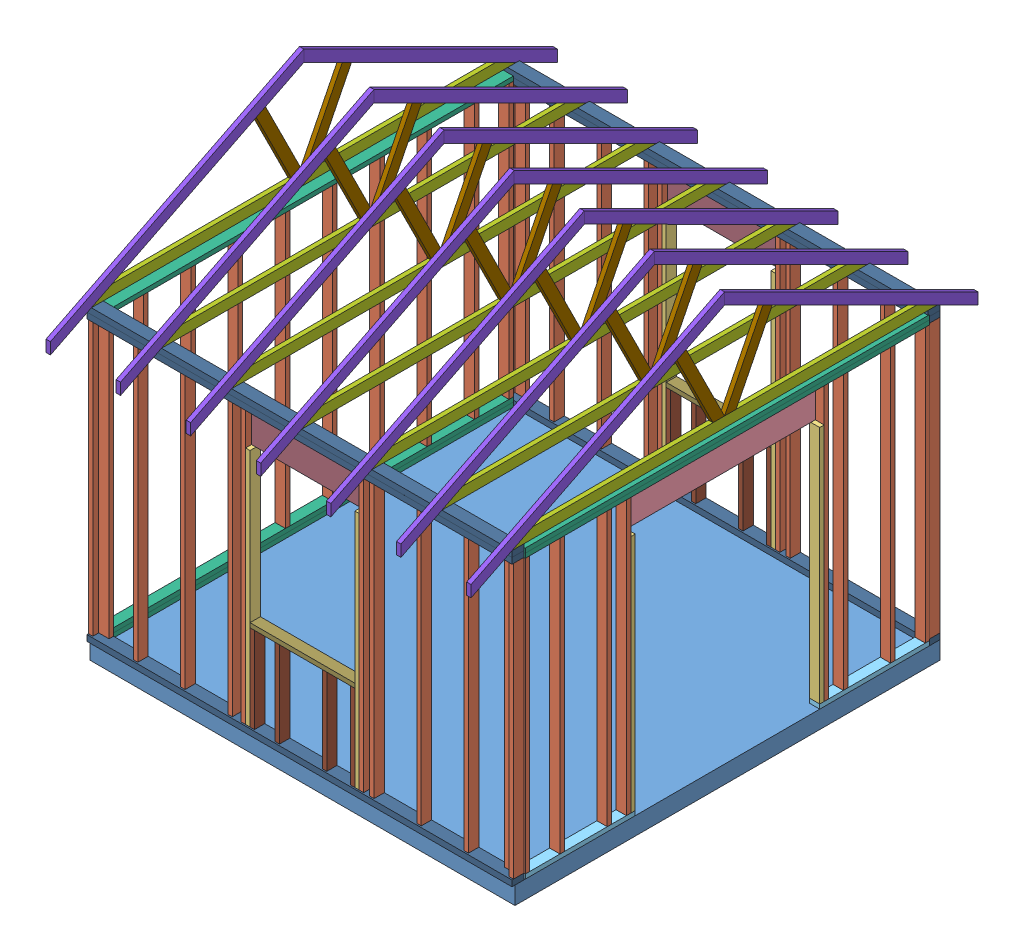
SolidWorks assembly DESN220-51C-MKrueger-complete shed.SLDASM, configuration Default (file format 6000). Lengths in mm.
Overall size (3657.6 3671.47 4441.28).
125 component instances, 13 part files, 17 mates.
Components (placement in the parent):
- DESN220-51C-MKrueger-SLAB-2: DESN220-51C-MKrueger-SLAB.SLDPRT [Default] at origin size (3657.6 152.4 3657.6)
- DESN220-51C-MKrueger-front wall with doorway-1: DESN220-51C-MKrueger-front wall with doorway.SLDASM [Default] at (1841.5 139.7 -1917.7) size (88.9 2466.97 3479.8)
  - DESN220-51C-MKrueger-2x4 STUD-1: DESN220-51C-MKrueger-2x4 STUD.SLDPRT [Default] at (-12.7 2403.475 177.8) x (1 0 0) z (0 -1 0) size (88.9 38.1 2352.68)
  - DESN220-51C-MKrueger-2x4x81-125-1: DESN220-51C-MKrueger-2x4x81-125.SLDPRT [Default] at (-12.7 50.8 2749.55) x (1 0 0) z (0 1 0) size (88.9 38.1 2060.57)
  - DESN220-51C-MKrueger-2x4x81-125-2: DESN220-51C-MKrueger-2x4x81-125.SLDPRT [Default] at (-12.7 2111.375 1085.85) x (1 0 0) z (0 -1 0) size (88.9 38.1 2060.57)
  - DESN220-51C-MKrueger-2x4 STUD-7: DESN220-51C-MKrueger-2x4 STUD.SLDPRT [Default] at (-12.7 2403.475 3619.5) x (1 0 0) z (0 -1 0) size (88.9 38.1 2352.68)
  - DESN220-51C-MKrueger-2x12x65-500-1: DESN220-51C-MKrueger-2x12x65-500.SLDPRT [Default] at (-88.9 2257.425 1917.7) x (0 0 -1) z (0 1 0) size (1663.7 12.7 292.1)
  - DESN220-51C-MKrueger-2x4 STUD-16: DESN220-51C-MKrueger-2x4 STUD.SLDPRT [Default] at (-12.7 2403.475 1047.75) x (1 0 0) z (0 -1 0) size (88.9 38.1 2352.68)
  - DESN220-51C-MKrueger-2x4 STUD-18: DESN220-51C-MKrueger-2x4 STUD.SLDPRT [Default] at (-12.7 2403.475 2749.55) x (1 0 0) z (0 -1 0) size (88.9 38.1 2352.68)
  - DESN220-51C-MKrueger-2x4x37-250-1: DESN220-51C-MKrueger-2x4x37-250.SLDPRT [Default] at (-57.15 12.7 3184.525) size (88.9 38.1 946.15)
  - DESN220-51C-MKrueger-2x4x37-250-2: DESN220-51C-MKrueger-2x4x37-250.SLDPRT [Default] at (-57.15 12.7 650.875) size (88.9 38.1 946.15)
  - DESN220-51C-MKrueger-2x4x137-1: DESN220-51C-MKrueger-2x4x137.SLDPRT [Default] at (-12.7 2403.475 177.8) size (88.9 38.1 3479.8)
  - DESN220-51C-MKrueger-2x4x137-2: DESN220-51C-MKrueger-2x4x137.SLDPRT [Default] at (-12.7 2441.575 177.8) size (88.9 38.1 3479.8)
  - DESN220-51C-MKrueger-2x4 STUD-19: DESN220-51C-MKrueger-2x4 STUD.SLDPRT [Default] at (-12.7 2403.475 476.25) x (1 0 0) z (0 -1 0) size (88.9 38.1 2352.68)
  - DESN220-51C-MKrueger-2x4 STUD-20: DESN220-51C-MKrueger-2x4 STUD.SLDPRT [Default] at (-12.7 2403.475 882.65) x (1 0 0) z (0 -1 0) size (88.9 38.1 2352.68)
  - DESN220-51C-MKrueger-2x4 STUD-21: DESN220-51C-MKrueger-2x4 STUD.SLDPRT [Default] at (-12.7 2403.475 2914.65) x (1 0 0) z (0 -1 0) size (88.9 38.1 2352.68)
  - DESN220-51C-MKrueger-2x4 STUD-22: DESN220-51C-MKrueger-2x4 STUD.SLDPRT [Default] at (-12.7 2403.475 3321.05) x (1 0 0) z (0 -1 0) size (88.9 38.1 2352.68)
- DESN220-51C-MKrueger-Roof Truss-1: DESN220-51C-MKrueger-Roof Truss.SLDASM [Default] at (1790.7 2657.475 -1803.4) x (0 -1 0) z (0 0 1) size (1190.07 38.1 4441.28)
  - DESN220-51C-MKrueger-2x4x144 63.43º-2: DESN220-51C-MKrueger-2x4x144 63.43º.SLDPRT [Default] at origin size (88.9 38.1 3657.6)
  - DESN220-51C-MKrueger-2x4x96 26.57º-1: DESN220-51C-MKrueger-2x4x96 26.57º.SLDPRT [Default] at (-1013.995 38.1 1828.8) x (-0.894389 0 0.447291) z (0.447291 0 0.894389) size (88.9 38.1 2482.86)
  - DESN220-51C-MKrueger-2x4x96 26.57º-2: DESN220-51C-MKrueger-2x4x96 26.57º.SLDPRT [Default] at (176.0765 0 -352.0771) x (0.894389 0 0.447291) z (-0.447291 0 0.894389) size (88.9 38.1 2482.86)
  - DESN220-51C-MKrueger-2x4x29.07 26.57º-1: DESN220-51C-MKrueger-2x4x29.07 26.57º.SLDPRT [Default] at (-749.2968 0 2159.3299) x (-0.447291 0 -0.894389) z (0.894389 0 -0.447291) size (88.9 38.1 738.38)
  - DESN220-51C-MKrueger-2x4x29.07 26.57º-2: DESN220-51C-MKrueger-2x4x29.07 26.57º.SLDPRT [Default] at (-749.2968 38.1 1498.2701) x (-0.447291 0 0.894389) z (0.894389 0 0.447291) size (88.9 38.1 738.38)
- DESN220-51C-MKrueger-Wall with window-1: DESN220-51C-MKrueger-Wall with window.SLDASM [Default] at (1828.8 152.4 -1727.2) x (0 0 1) z (-1 0 0) size (101.6 2505.08 3657.6)
  - DESN220-51C-MKrueger-2x4x144-5: DESN220-51C-MKrueger-2x4x144.SLDPRT [Default] at origin size (101.6 50.8 3657.6)
  - DESN220-51C-MKrueger-2x4 STUD-1: DESN220-51C-MKrueger-2x4 STUD.SLDPRT [Default] at (-12.7 2403.475 0) x (1 0 0) z (0 -1 0) size (88.9 38.1 2352.68)
  - DESN220-51C-MKrueger-2x4 STUD-2: DESN220-51C-MKrueger-2x4 STUD.SLDPRT [Default] at (-12.7 2403.475 387.35) x (1 0 0) z (0 -1 0) size (88.9 38.1 2352.68)
  - DESN220-51C-MKrueger-2x4 STUD-4: DESN220-51C-MKrueger-2x4 STUD.SLDPRT [Default] at (-101.6 50.8 127) x (0 0 1) z (0 1 0) size (88.9 38.1 2352.68)
  - DESN220-51C-MKrueger-2x4x29-125-1: DESN220-51C-MKrueger-2x4x29-125.SLDPRT [Default] at (-12.7 50.8 2266.95) x (1 0 0) z (0 1 0) size (88.9 38.1 739.77)
  - DESN220-51C-MKrueger-2x4x29-125-2: DESN220-51C-MKrueger-2x4x29-125.SLDPRT [Default] at (-12.7 50.8 1403.35) x (1 0 0) z (0 1 0) size (88.9 38.1 739.77)
  - DESN220-51C-MKrueger-2x4x29-125-3: DESN220-51C-MKrueger-2x4x29-125.SLDPRT [Default] at (-12.7 790.575 1606.55) x (1 0 0) z (0 -1 0) size (88.9 38.1 739.77)
  - DESN220-51C-MKrueger-2x4x29-125-4: DESN220-51C-MKrueger-2x4x29-125.SLDPRT [Default] at (-12.7 790.575 2012.95) x (1 0 0) z (0 -1 0) size (88.9 38.1 739.77)
  - DESN220-51C-MKrueger-2x4 STUD-6: DESN220-51C-MKrueger-2x4 STUD.SLDPRT [Default] at (-12.7 2403.475 2305.05) x (1 0 0) z (0 -1 0) size (88.9 38.1 2352.68)
  - DESN220-51C-MKrueger-2x4x81-125-1: DESN220-51C-MKrueger-2x4x81-125.SLDPRT [Default] at (-12.7 50.8 2305.05) x (1 0 0) z (0 1 0) size (88.9 38.1 2060.57)
  - DESN220-51C-MKrueger-2x4x35-500-1: DESN220-51C-MKrueger-2x4x35-500.SLDPRT [Default] at (-12.7 790.575 1365.25) size (88.9 38.1 901.7)
  - DESN220-51C-MKrueger-2x4x81-125-2: DESN220-51C-MKrueger-2x4x81-125.SLDPRT [Default] at (-12.7 2111.375 1327.15) x (1 0 0) z (0 -1 0) size (88.9 38.1 2060.57)
  - DESN220-51C-MKrueger-2x12x38-500-1: DESN220-51C-MKrueger-2x12x38-500.SLDPRT [Default] at (-101.6 2111.375 1327.15) x (0 -1 0) z (0 0 1) size (292.1 38.1 977.9)
  - DESN220-51C-MKrueger-2x4 STUD-7: DESN220-51C-MKrueger-2x4 STUD.SLDPRT [Default] at (-12.7 2403.475 3619.5) x (1 0 0) z (0 -1 0) size (88.9 38.1 2352.68)
  - DESN220-51C-MKrueger-2x4 STUD-8: DESN220-51C-MKrueger-2x4 STUD.SLDPRT [Default] at (-101.6 2403.475 3530.6) x (0 0 -1) z (0 -1 0) size (88.9 38.1 2352.68)
  - DESN220-51C-MKrueger-2x4 STUD-9: DESN220-51C-MKrueger-2x4 STUD.SLDPRT [Default] at (-12.7 2403.475 793.75) x (1 0 0) z (0 -1 0) size (88.9 38.1 2352.68)
  - DESN220-51C-MKrueger-2x4 STUD-10: DESN220-51C-MKrueger-2x4 STUD.SLDPRT [Default] at (-12.7 2403.475 1200.15) x (1 0 0) z (0 -1 0) size (88.9 38.1 2352.68)
  - DESN220-51C-MKrueger-2x4 STUD-11: DESN220-51C-MKrueger-2x4 STUD.SLDPRT [Default] at (-12.7 2403.475 1606.55) x (1 0 0) z (0 -1 0) size (88.9 38.1 2352.68) (suppressed, hidden)
  - DESN220-51C-MKrueger-2x4 STUD-12: DESN220-51C-MKrueger-2x4 STUD.SLDPRT [Default] at (-12.7 2403.475 2012.95) x (1 0 0) z (0 -1 0) size (88.9 38.1 2352.68) (suppressed, hidden)
  - DESN220-51C-MKrueger-2x4 STUD-13: DESN220-51C-MKrueger-2x4 STUD.SLDPRT [Default] at (-12.7 2403.475 2419.35) x (1 0 0) z (0 -1 0) size (88.9 38.1 2352.68)
  - DESN220-51C-MKrueger-2x4 STUD-14: DESN220-51C-MKrueger-2x4 STUD.SLDPRT [Default] at (-12.7 2403.475 2825.75) x (1 0 0) z (0 -1 0) size (88.9 38.1 2352.68)
  - DESN220-51C-MKrueger-2x4 STUD-15: DESN220-51C-MKrueger-2x4 STUD.SLDPRT [Default] at (-12.7 2403.475 3232.15) x (1 0 0) z (0 -1 0) size (88.9 38.1 2352.68)
  - DESN220-51C-MKrueger-2x4x144-6: DESN220-51C-MKrueger-2x4x144.SLDPRT [Default] at (0 2454.275 0) size (101.6 50.8 3657.6)
  - DESN220-51C-MKrueger-2x4x144-7: DESN220-51C-MKrueger-2x4x144.SLDPRT [Default] at (0 2403.475 0) size (101.6 50.8 3657.6)
  - DESN220-51C-MKrueger-2x4 STUD-16: DESN220-51C-MKrueger-2x4 STUD.SLDPRT [Default] at (-12.7 50.8 1327.15) x (1 0 0) z (0 1 0) size (88.9 38.1 2352.68)
- DESN220-51C-MKrueger-Wall without window-1: DESN220-51C-MKrueger-Wall without window.SLDASM [Default] at (-1828.8 228.6 1752.6) x (0 1 0) z (0 0 -1) size (2466.98 88.9 3479.8)
  - DESN220-51C-MKrueger-2x4x137-3: DESN220-51C-MKrueger-2x4x137.SLDPRT [Default] at (0 88.9 0) x (0 1 0) z (0 0 1) size (88.9 38.1 3479.8)
  - DESN220-51C-MKrueger-2x4 STUD-2: DESN220-51C-MKrueger-2x4 STUD.SLDPRT [Default] at (2352.675 0 0) x (0 -1 0) z (-1 0 0) size (88.9 38.1 2352.68)
  - DESN220-51C-MKrueger-2x4x137-4: DESN220-51C-MKrueger-2x4x137.SLDPRT [Default] at (-76.2 0 0) x (0 -1 0) z (0 0 1) size (88.9 38.1 3479.8)
  - DESN220-51C-MKrueger-2x4x137-5: DESN220-51C-MKrueger-2x4x137.SLDPRT [Default] at (2390.775 88.9 0) x (0 1 0) z (0 0 1) size (88.9 38.1 3479.8)
  - DESN220-51C-MKrueger-2x4 STUD-3: DESN220-51C-MKrueger-2x4 STUD.SLDPRT [Default] at (2352.675 0 298.45) x (0 -1 0) z (-1 0 0) size (88.9 38.1 2352.68)
  - DESN220-51C-MKrueger-2x4 STUD-5: DESN220-51C-MKrueger-2x4 STUD.SLDPRT [Default] at (0 0 742.95) x (0 -1 0) z (1 0 0) size (88.9 38.1 2352.68)
  - DESN220-51C-MKrueger-2x4 STUD-6: DESN220-51C-MKrueger-2x4 STUD.SLDPRT [Default] at (0 0 1149.35) x (0 -1 0) z (1 0 0) size (88.9 38.1 2352.68)
  - DESN220-51C-MKrueger-2x4 STUD-7: DESN220-51C-MKrueger-2x4 STUD.SLDPRT [Default] at (0 0 1555.75) x (0 -1 0) z (1 0 0) size (88.9 38.1 2352.68)
  - DESN220-51C-MKrueger-2x4 STUD-8: DESN220-51C-MKrueger-2x4 STUD.SLDPRT [Default] at (0 0 2368.55) x (0 -1 0) z (1 0 0) size (88.9 38.1 2352.68)
  - DESN220-51C-MKrueger-2x4 STUD-9: DESN220-51C-MKrueger-2x4 STUD.SLDPRT [Default] at (0 0 1962.15) x (0 -1 0) z (1 0 0) size (88.9 38.1 2352.68)
  - DESN220-51C-MKrueger-2x4 STUD-10: DESN220-51C-MKrueger-2x4 STUD.SLDPRT [Default] at (0 0 3181.35) x (0 -1 0) z (1 0 0) size (88.9 38.1 2352.68)
  - DESN220-51C-MKrueger-2x4 STUD-11: DESN220-51C-MKrueger-2x4 STUD.SLDPRT [Default] at (0 0 2774.95) x (0 -1 0) z (1 0 0) size (88.9 38.1 2352.68)
  - DESN220-51C-MKrueger-2x4 STUD-12: DESN220-51C-MKrueger-2x4 STUD.SLDPRT [Default] at (2352.675 88.9 3479.8) x (0 1 0) z (-1 0 0) size (88.9 38.1 2352.68)
- DESN220-51C-MKrueger-Wall with window-2: DESN220-51C-MKrueger-Wall with window.SLDASM [Default] at (1828.8 152.4 1854.2) x (0 0 1) z (-1 0 0) size (101.6 2505.08 3657.6)
  - DESN220-51C-MKrueger-2x4x144-5: DESN220-51C-MKrueger-2x4x144.SLDPRT [Default] at origin size (101.6 50.8 3657.6)
  - DESN220-51C-MKrueger-2x4 STUD-1: DESN220-51C-MKrueger-2x4 STUD.SLDPRT [Default] at (-12.7 2403.475 0) x (1 0 0) z (0 -1 0) size (88.9 38.1 2352.68)
  - DESN220-51C-MKrueger-2x4 STUD-2: DESN220-51C-MKrueger-2x4 STUD.SLDPRT [Default] at (-12.7 2403.475 387.35) x (1 0 0) z (0 -1 0) size (88.9 38.1 2352.68)
  - DESN220-51C-MKrueger-2x4 STUD-4: DESN220-51C-MKrueger-2x4 STUD.SLDPRT [Default] at (-101.6 50.8 127) x (0 0 1) z (0 1 0) size (88.9 38.1 2352.68)
  - DESN220-51C-MKrueger-2x4x29-125-1: DESN220-51C-MKrueger-2x4x29-125.SLDPRT [Default] at (-12.7 50.8 2266.95) x (1 0 0) z (0 1 0) size (88.9 38.1 739.77)
  - DESN220-51C-MKrueger-2x4x29-125-2: DESN220-51C-MKrueger-2x4x29-125.SLDPRT [Default] at (-12.7 50.8 1403.35) x (1 0 0) z (0 1 0) size (88.9 38.1 739.77)
  - DESN220-51C-MKrueger-2x4x29-125-3: DESN220-51C-MKrueger-2x4x29-125.SLDPRT [Default] at (-12.7 790.575 1606.55) x (1 0 0) z (0 -1 0) size (88.9 38.1 739.77)
  - DESN220-51C-MKrueger-2x4x29-125-4: DESN220-51C-MKrueger-2x4x29-125.SLDPRT [Default] at (-12.7 790.575 2012.95) x (1 0 0) z (0 -1 0) size (88.9 38.1 739.77)
  - DESN220-51C-MKrueger-2x4 STUD-6: DESN220-51C-MKrueger-2x4 STUD.SLDPRT [Default] at (-12.7 2403.475 2305.05) x (1 0 0) z (0 -1 0) size (88.9 38.1 2352.68)
  - DESN220-51C-MKrueger-2x4x81-125-1: DESN220-51C-MKrueger-2x4x81-125.SLDPRT [Default] at (-12.7 50.8 2305.05) x (1 0 0) z (0 1 0) size (88.9 38.1 2060.57)
  - DESN220-51C-MKrueger-2x4x35-500-1: DESN220-51C-MKrueger-2x4x35-500.SLDPRT [Default] at (-12.7 790.575 1365.25) size (88.9 38.1 901.7)
  - DESN220-51C-MKrueger-2x4x81-125-2: DESN220-51C-MKrueger-2x4x81-125.SLDPRT [Default] at (-12.7 2111.375 1327.15) x (1 0 0) z (0 -1 0) size (88.9 38.1 2060.57)
  - DESN220-51C-MKrueger-2x12x38-500-1: DESN220-51C-MKrueger-2x12x38-500.SLDPRT [Default] at (-101.6 2111.375 1327.15) x (0 -1 0) z (0 0 1) size (292.1 38.1 977.9)
  - DESN220-51C-MKrueger-2x4 STUD-7: DESN220-51C-MKrueger-2x4 STUD.SLDPRT [Default] at (-12.7 2403.475 3619.5) x (1 0 0) z (0 -1 0) size (88.9 38.1 2352.68)
  - DESN220-51C-MKrueger-2x4 STUD-8: DESN220-51C-MKrueger-2x4 STUD.SLDPRT [Default] at (-101.6 2403.475 3530.6) x (0 0 -1) z (0 -1 0) size (88.9 38.1 2352.68)
  - DESN220-51C-MKrueger-2x4 STUD-9: DESN220-51C-MKrueger-2x4 STUD.SLDPRT [Default] at (-12.7 2403.475 793.75) x (1 0 0) z (0 -1 0) size (88.9 38.1 2352.68)
  - DESN220-51C-MKrueger-2x4 STUD-10: DESN220-51C-MKrueger-2x4 STUD.SLDPRT [Default] at (-12.7 2403.475 1200.15) x (1 0 0) z (0 -1 0) size (88.9 38.1 2352.68)
  - DESN220-51C-MKrueger-2x4 STUD-11: DESN220-51C-MKrueger-2x4 STUD.SLDPRT [Default] at (-12.7 2403.475 1606.55) x (1 0 0) z (0 -1 0) size (88.9 38.1 2352.68) (suppressed, hidden)
  - DESN220-51C-MKrueger-2x4 STUD-12: DESN220-51C-MKrueger-2x4 STUD.SLDPRT [Default] at (-12.7 2403.475 2012.95) x (1 0 0) z (0 -1 0) size (88.9 38.1 2352.68) (suppressed, hidden)
  - DESN220-51C-MKrueger-2x4 STUD-13: DESN220-51C-MKrueger-2x4 STUD.SLDPRT [Default] at (-12.7 2403.475 2419.35) x (1 0 0) z (0 -1 0) size (88.9 38.1 2352.68)
  - DESN220-51C-MKrueger-2x4 STUD-14: DESN220-51C-MKrueger-2x4 STUD.SLDPRT [Default] at (-12.7 2403.475 2825.75) x (1 0 0) z (0 -1 0) size (88.9 38.1 2352.68)
  - DESN220-51C-MKrueger-2x4 STUD-15: DESN220-51C-MKrueger-2x4 STUD.SLDPRT [Default] at (-12.7 2403.475 3232.15) x (1 0 0) z (0 -1 0) size (88.9 38.1 2352.68)
  - DESN220-51C-MKrueger-2x4x144-6: DESN220-51C-MKrueger-2x4x144.SLDPRT [Default] at (0 2454.275 0) size (101.6 50.8 3657.6)
  - DESN220-51C-MKrueger-2x4x144-7: DESN220-51C-MKrueger-2x4x144.SLDPRT [Default] at (0 2403.475 0) size (101.6 50.8 3657.6)
  - DESN220-51C-MKrueger-2x4 STUD-16: DESN220-51C-MKrueger-2x4 STUD.SLDPRT [Default] at (-12.7 50.8 1327.15) x (1 0 0) z (0 1 0) size (88.9 38.1 2352.68)
- DESN220-51C-MKrueger-Roof Truss-2: DESN220-51C-MKrueger-Roof Truss.SLDASM [Default] at (1187.45 2657.475 -1803.4) x (0 -1 0) z (0 0 1) size (1190.07 38.1 4441.28)
  - DESN220-51C-MKrueger-2x4x144 63.43º-2: DESN220-51C-MKrueger-2x4x144 63.43º.SLDPRT [Default] at origin size (88.9 38.1 3657.6)
  - DESN220-51C-MKrueger-2x4x96 26.57º-1: DESN220-51C-MKrueger-2x4x96 26.57º.SLDPRT [Default] at (-1013.995 38.1 1828.8) x (-0.894389 0 0.447291) z (0.447291 0 0.894389) size (88.9 38.1 2482.86)
  - DESN220-51C-MKrueger-2x4x96 26.57º-2: DESN220-51C-MKrueger-2x4x96 26.57º.SLDPRT [Default] at (176.0765 0 -352.0771) x (0.894389 0 0.447291) z (-0.447291 0 0.894389) size (88.9 38.1 2482.86)
  - DESN220-51C-MKrueger-2x4x29.07 26.57º-1: DESN220-51C-MKrueger-2x4x29.07 26.57º.SLDPRT [Default] at (-749.2968 0 2159.3299) x (-0.447291 0 -0.894389) z (0.894389 0 -0.447291) size (88.9 38.1 738.38)
  - DESN220-51C-MKrueger-2x4x29.07 26.57º-2: DESN220-51C-MKrueger-2x4x29.07 26.57º.SLDPRT [Default] at (-749.2968 38.1 1498.2701) x (-0.447291 0 0.894389) z (0.894389 0 0.447291) size (88.9 38.1 738.38)
- DESN220-51C-MKrueger-Roof Truss-3: DESN220-51C-MKrueger-Roof Truss.SLDASM [Default] at (584.2 2657.475 -1803.4) x (0 -1 0) z (0 0 1) size (1190.07 38.1 4441.28)
  - DESN220-51C-MKrueger-2x4x144 63.43º-2: DESN220-51C-MKrueger-2x4x144 63.43º.SLDPRT [Default] at origin size (88.9 38.1 3657.6)
  - DESN220-51C-MKrueger-2x4x96 26.57º-1: DESN220-51C-MKrueger-2x4x96 26.57º.SLDPRT [Default] at (-1013.995 38.1 1828.8) x (-0.894389 0 0.447291) z (0.447291 0 0.894389) size (88.9 38.1 2482.86)
  - DESN220-51C-MKrueger-2x4x96 26.57º-2: DESN220-51C-MKrueger-2x4x96 26.57º.SLDPRT [Default] at (176.0765 0 -352.0771) x (0.894389 0 0.447291) z (-0.447291 0 0.894389) size (88.9 38.1 2482.86)
  - DESN220-51C-MKrueger-2x4x29.07 26.57º-1: DESN220-51C-MKrueger-2x4x29.07 26.57º.SLDPRT [Default] at (-749.2968 0 2159.3299) x (-0.447291 0 -0.894389) z (0.894389 0 -0.447291) size (88.9 38.1 738.38)
  - DESN220-51C-MKrueger-2x4x29.07 26.57º-2: DESN220-51C-MKrueger-2x4x29.07 26.57º.SLDPRT [Default] at (-749.2968 38.1 1498.2701) x (-0.447291 0 0.894389) z (0.894389 0 0.447291) size (88.9 38.1 738.38)
- DESN220-51C-MKrueger-Roof Truss-4: DESN220-51C-MKrueger-Roof Truss.SLDASM [Default] at (-19.05 2657.475 -1803.4) x (0 -1 0) z (0 0 1) size (1190.07 38.1 4441.28)
  - DESN220-51C-MKrueger-2x4x144 63.43º-2: DESN220-51C-MKrueger-2x4x144 63.43º.SLDPRT [Default] at origin size (88.9 38.1 3657.6)
  - DESN220-51C-MKrueger-2x4x96 26.57º-1: DESN220-51C-MKrueger-2x4x96 26.57º.SLDPRT [Default] at (-1013.995 38.1 1828.8) x (-0.894389 0 0.447291) z (0.447291 0 0.894389) size (88.9 38.1 2482.86)
  - DESN220-51C-MKrueger-2x4x96 26.57º-2: DESN220-51C-MKrueger-2x4x96 26.57º.SLDPRT [Default] at (176.0765 0 -352.0771) x (0.894389 0 0.447291) z (-0.447291 0 0.894389) size (88.9 38.1 2482.86)
  - DESN220-51C-MKrueger-2x4x29.07 26.57º-1: DESN220-51C-MKrueger-2x4x29.07 26.57º.SLDPRT [Default] at (-749.2968 0 2159.3299) x (-0.447291 0 -0.894389) z (0.894389 0 -0.447291) size (88.9 38.1 738.38)
  - DESN220-51C-MKrueger-2x4x29.07 26.57º-2: DESN220-51C-MKrueger-2x4x29.07 26.57º.SLDPRT [Default] at (-749.2968 38.1 1498.2701) x (-0.447291 0 0.894389) z (0.894389 0 0.447291) size (88.9 38.1 738.38)
- DESN220-51C-MKrueger-Roof Truss-5: DESN220-51C-MKrueger-Roof Truss.SLDASM [Default] at (-622.3 2657.475 -1803.4) x (0 -1 0) z (0 0 1) size (1190.07 38.1 4441.28)
  - DESN220-51C-MKrueger-2x4x144 63.43º-2: DESN220-51C-MKrueger-2x4x144 63.43º.SLDPRT [Default] at origin size (88.9 38.1 3657.6)
  - DESN220-51C-MKrueger-2x4x96 26.57º-1: DESN220-51C-MKrueger-2x4x96 26.57º.SLDPRT [Default] at (-1013.995 38.1 1828.8) x (-0.894389 0 0.447291) z (0.447291 0 0.894389) size (88.9 38.1 2482.86)
  - DESN220-51C-MKrueger-2x4x96 26.57º-2: DESN220-51C-MKrueger-2x4x96 26.57º.SLDPRT [Default] at (176.0765 0 -352.0771) x (0.894389 0 0.447291) z (-0.447291 0 0.894389) size (88.9 38.1 2482.86)
  - DESN220-51C-MKrueger-2x4x29.07 26.57º-1: DESN220-51C-MKrueger-2x4x29.07 26.57º.SLDPRT [Default] at (-749.2968 0 2159.3299) x (-0.447291 0 -0.894389) z (0.894389 0 -0.447291) size (88.9 38.1 738.38)
  - DESN220-51C-MKrueger-2x4x29.07 26.57º-2: DESN220-51C-MKrueger-2x4x29.07 26.57º.SLDPRT [Default] at (-749.2968 38.1 1498.2701) x (-0.447291 0 0.894389) z (0.894389 0 0.447291) size (88.9 38.1 738.38)
- DESN220-51C-MKrueger-Roof Truss-6: DESN220-51C-MKrueger-Roof Truss.SLDASM [Default] at (-1225.55 2657.475 -1803.4) x (0 -1 0) z (0 0 1) size (1190.07 38.1 4441.28)
  - DESN220-51C-MKrueger-2x4x144 63.43º-2: DESN220-51C-MKrueger-2x4x144 63.43º.SLDPRT [Default] at origin size (88.9 38.1 3657.6)
  - DESN220-51C-MKrueger-2x4x96 26.57º-1: DESN220-51C-MKrueger-2x4x96 26.57º.SLDPRT [Default] at (-1013.995 38.1 1828.8) x (-0.894389 0 0.447291) z (0.447291 0 0.894389) size (88.9 38.1 2482.86)
  - DESN220-51C-MKrueger-2x4x96 26.57º-2: DESN220-51C-MKrueger-2x4x96 26.57º.SLDPRT [Default] at (176.0765 0 -352.0771) x (0.894389 0 0.447291) z (-0.447291 0 0.894389) size (88.9 38.1 2482.86)
  - DESN220-51C-MKrueger-2x4x29.07 26.57º-1: DESN220-51C-MKrueger-2x4x29.07 26.57º.SLDPRT [Default] at (-749.2968 0 2159.3299) x (-0.447291 0 -0.894389) z (0.894389 0 -0.447291) size (88.9 38.1 738.38)
  - DESN220-51C-MKrueger-2x4x29.07 26.57º-2: DESN220-51C-MKrueger-2x4x29.07 26.57º.SLDPRT [Default] at (-749.2968 38.1 1498.2701) x (-0.447291 0 0.894389) z (0.894389 0 0.447291) size (88.9 38.1 738.38)
- DESN220-51C-MKrueger-Roof Truss-7: DESN220-51C-MKrueger-Roof Truss.SLDASM [Default] at (-1828.8 2657.475 -1803.4) x (0 -1 0) z (0 0 1) size (1190.07 38.1 4441.28)
  - DESN220-51C-MKrueger-2x4x144 63.43º-2: DESN220-51C-MKrueger-2x4x144 63.43º.SLDPRT [Default] at origin size (88.9 38.1 3657.6)
  - DESN220-51C-MKrueger-2x4x96 26.57º-1: DESN220-51C-MKrueger-2x4x96 26.57º.SLDPRT [Default] at (-1013.995 38.1 1828.8) x (-0.894389 0 0.447291) z (0.447291 0 0.894389) size (88.9 38.1 2482.86)
  - DESN220-51C-MKrueger-2x4x96 26.57º-2: DESN220-51C-MKrueger-2x4x96 26.57º.SLDPRT [Default] at (176.0765 0 -352.0771) x (0.894389 0 0.447291) z (-0.447291 0 0.894389) size (88.9 38.1 2482.86)
  - DESN220-51C-MKrueger-2x4x29.07 26.57º-1: DESN220-51C-MKrueger-2x4x29.07 26.57º.SLDPRT [Default] at (-749.2968 0 2159.3299) x (-0.447291 0 -0.894389) z (0.894389 0 -0.447291) size (88.9 38.1 738.38)
  - DESN220-51C-MKrueger-2x4x29.07 26.57º-2: DESN220-51C-MKrueger-2x4x29.07 26.57º.SLDPRT [Default] at (-749.2968 38.1 1498.2701) x (-0.447291 0 0.894389) z (0.894389 0 0.447291) size (88.9 38.1 738.38)
Mates (geometry in assembly coordinates):
- Coincident3: coordinate: point of DESN220-51C-MKrueger-SLAB-2; point of assembly
- Coincident4: coincident anti-aligned: plane of DESN220-51C-MKrueger-SLAB-2 through (0 152.4 0) normal (0 1 0); plane of DESN220-51C-MKrueger-front wall with doorway-1/DESN220-51C-MKrueger-2x4x37-250-1 through (1784.35 152.4 1266.825) normal (0 -1 0)
- Coincident6: coincident aligned: plane of DESN220-51C-MKrueger-SLAB-2 through (1828.8 152.4 1828.8) normal (1 0 0); plane of DESN220-51C-MKrueger-front wall with doorway-1/DESN220-51C-MKrueger-2x4x37-250-1 through (1828.8 190.5 1739.9) normal (1 0 0)
- Coincident7: coincident anti-aligned: plane of DESN220-51C-MKrueger-SLAB-2 through (0 152.4 0) normal (0 1 0); plane of DESN220-51C-MKrueger-Wall with window-1/DESN220-51C-MKrueger-2x4x144-5 through (1828.8 152.4 -1727.2) normal (0 -1 0)
- Coincident8: coincident anti-aligned: plane of DESN220-51C-MKrueger-front wall with doorway-1/DESN220-51C-MKrueger-2x4 STUD-1 through (1828.8 2543.175 -1739.9) normal (0 0 -1); plane of DESN220-51C-MKrueger-Wall with window-1/DESN220-51C-MKrueger-2x4 STUD-1 through (1790.7 2555.875 -1739.9) normal (0 0 1)
- Coincident9: coincident aligned: plane of DESN220-51C-MKrueger-front wall with doorway-1/DESN220-51C-MKrueger-2x4x137-1 through (1828.8 2581.275 -1739.9) normal (1 0 0); plane of DESN220-51C-MKrueger-Wall with window-1/DESN220-51C-MKrueger-2x4x144-6 through (1828.8 2657.475 -1828.8) normal (1 0 0)
- Coincident10: coincident: line of DESN220-51C-MKrueger-Wall with window-1/DESN220-51C-MKrueger-2x4x144-5 through (1828.8 203.2 -1828.8) axis (-1 0 0); plane of DESN220-51C-MKrueger-SLAB-2 through (-1828.8 152.4 -1828.8) normal (0 0 -1)
- Coincident11: coincident aligned: plane of DESN220-51C-MKrueger-SLAB-2 through (-1828.8 152.4 -1828.8) normal (0 0 -1); plane of DESN220-51C-MKrueger-Wall with window-1/DESN220-51C-MKrueger-2x4x144-5 through (-1828.8 203.2 -1828.8) normal (0 0 -1)
- Coincident13: coincident aligned: plane of DESN220-51C-MKrueger-Wall with window-1/DESN220-51C-MKrueger-2x4x144-6 through (-1828.8 2657.475 -1727.2) normal (-1 0 0); plane of DESN220-51C-MKrueger-Wall without window-1/DESN220-51C-MKrueger-2x4x137-5 through (-1828.8 2581.275 -1727.2) normal (-1 0 0)
- Coincident14: coincident anti-aligned: plane of DESN220-51C-MKrueger-SLAB-2 through (0 152.4 0) normal (0 1 0); plane of DESN220-51C-MKrueger-Wall without window-1/DESN220-51C-MKrueger-2x4x137-4 through (-1828.8 152.4 1752.6) normal (0 -1 0)
- Coincident15: coincident anti-aligned: plane of DESN220-51C-MKrueger-Wall with window-1/DESN220-51C-MKrueger-2x4x144-6 through (1828.8 2657.475 -1727.2) normal (0 0 1); plane of DESN220-51C-MKrueger-Wall without window-1/DESN220-51C-MKrueger-2x4 STUD-12 through (-1739.9 2581.275 -1727.2) normal (0 0 -1)
- Coincident16: coincident aligned: plane of DESN220-51C-MKrueger-Wall without window-1/DESN220-51C-MKrueger-2x4x137-5 through (-1828.8 2581.275 -1727.2) normal (-1 0 0); plane of DESN220-51C-MKrueger-Wall with window-2/DESN220-51C-MKrueger-2x4 STUD-7 through (-1828.8 2555.875 1841.5) normal (-1 0 0)
- Coincident18: coincident anti-aligned: plane of DESN220-51C-MKrueger-SLAB-2 through (0 152.4 0) normal (0 1 0); plane of DESN220-51C-MKrueger-Wall with window-2/DESN220-51C-MKrueger-2x4x144-5 through (1828.8 152.4 1854.2) normal (0 -1 0)
- Coincident19: coincident anti-aligned: plane of DESN220-51C-MKrueger-Wall without window-1/DESN220-51C-MKrueger-2x4 STUD-2 through (-1828.8 2581.275 1752.6) normal (0 0 1); plane of DESN220-51C-MKrueger-Wall with window-2/DESN220-51C-MKrueger-2x4x144-6 through (-1828.8 2657.475 1752.6) normal (0 0 -1)
- Coincident20: coincident anti-aligned: plane of DESN220-51C-MKrueger-Roof Truss-1/DESN220-51C-MKrueger-2x4x144 63.43º-2 through (1828.8 2657.475 -1803.4) normal (0 -1 0); plane of DESN220-51C-MKrueger-Wall with window-1/DESN220-51C-MKrueger-2x4x144-6 through (1828.8 2657.475 -1727.2) normal (0 1 0)
- Coincident21: coincident aligned: plane of DESN220-51C-MKrueger-Roof Truss-1/DESN220-51C-MKrueger-2x4x96 26.57º-2 through (1828.8 2481.3985 -2155.4771) normal (1 0 0); plane of DESN220-51C-MKrueger-Wall with window-1/DESN220-51C-MKrueger-2x4x144-6 through (1828.8 2657.475 -1828.8) normal (1 0 0)
- Coincident22: coincident anti-aligned: line of DESN220-51C-MKrueger-Roof Truss-1/DESN220-51C-MKrueger-2x4x144 63.43º-2 through (1828.8 2657.475 1854.2) axis (-1 0 0); line of DESN220-51C-MKrueger-Wall with window-2/DESN220-51C-MKrueger-2x4x144-6 through (-1828.8 2657.475 1854.2) axis (1 0 0)
